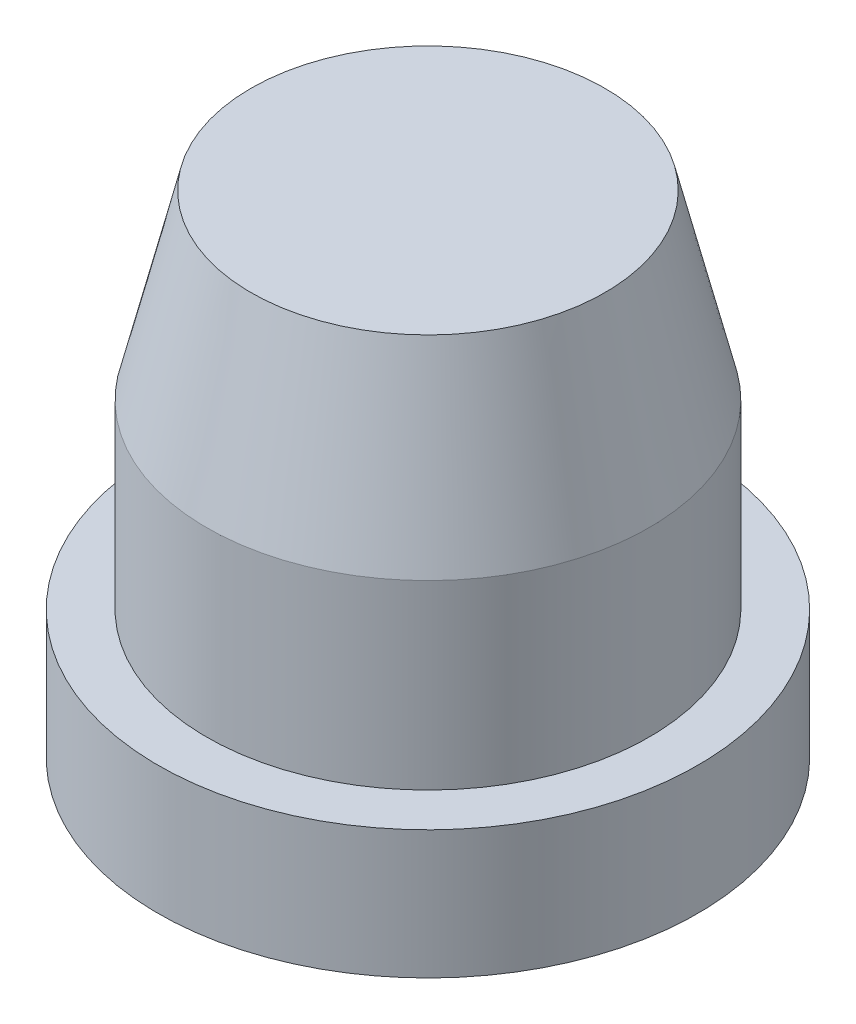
ISO-10303-21;
HEADER;
FILE_DESCRIPTION(('STEP AP214'),'2;1');
FILE_NAME('part.step','',(''),(''),'','','');
FILE_SCHEMA(('AUTOMOTIVE_DESIGN { 1 0 10303 214 1 1 1 1 }'));
ENDSEC;
DATA;
#1=APPLICATION_CONTEXT('core data for automotive mechanical design processes');
#2=APPLICATION_PROTOCOL_DEFINITION('international standard','automotive_design',2000,#1);
#3=PRODUCT_CONTEXT('',#1,'mechanical');
#4=PRODUCT('Part','Part','',(#3));
#5=PRODUCT_RELATED_PRODUCT_CATEGORY('part','',(#4));
#6=PRODUCT_DEFINITION_FORMATION('','',#4);
#7=PRODUCT_DEFINITION_CONTEXT('part definition',#1,'design');
#8=PRODUCT_DEFINITION('design','',#6,#7);
#9=PRODUCT_DEFINITION_SHAPE('','',#8);
#10=(LENGTH_UNIT() NAMED_UNIT(*) SI_UNIT(.MILLI.,.METRE.));
#11=(NAMED_UNIT(*) PLANE_ANGLE_UNIT() SI_UNIT($,.RADIAN.));
#12=(NAMED_UNIT(*) SI_UNIT($,.STERADIAN.) SOLID_ANGLE_UNIT());
#13=UNCERTAINTY_MEASURE_WITH_UNIT(LENGTH_MEASURE(1.E-05),#10,'distance_accuracy_value','');
#14=(GEOMETRIC_REPRESENTATION_CONTEXT(3) GLOBAL_UNCERTAINTY_ASSIGNED_CONTEXT((#13)) GLOBAL_UNIT_ASSIGNED_CONTEXT((#10,
#11,#12)) REPRESENTATION_CONTEXT('',''));
#15=CARTESIAN_POINT('',(0.,0.,0.));
#16=DIRECTION('',(0.,0.,1.));
#17=DIRECTION('',(1.,0.,0.));
#18=AXIS2_PLACEMENT_3D('',#15,#16,#17);
#19=CARTESIAN_POINT('',(0.,0.,0.));
#20=DIRECTION('',(0.,-1.,0.));
#21=DIRECTION('',(1.,0.,0.));
#22=AXIS2_PLACEMENT_3D('',#19,#20,#21);
#23=PLANE('',#22);
#24=CARTESIAN_POINT('',(0.,0.,0.));
#25=DIRECTION('',(0.,-1.,0.));
#26=DIRECTION('',(1.,0.,0.));
#27=AXIS2_PLACEMENT_3D('',#24,#25,#26);
#28=CIRCLE('',#27,4.3);
#29=CARTESIAN_POINT('',(4.3,0.,0.));
#30=VERTEX_POINT('',#29);
#31=EDGE_CURVE('E11',#30,#30,#28,.F.);
#32=ORIENTED_EDGE('',*,*,#31,.T.);
#33=EDGE_LOOP('',(#32));
#34=FACE_BOUND('',#33,.T.);
#35=CARTESIAN_POINT('',(0.,0.,0.));
#36=DIRECTION('',(0.,1.,0.));
#37=DIRECTION('',(-1.,0.,0.));
#38=AXIS2_PLACEMENT_3D('',#35,#36,#37);
#39=CIRCLE('',#38,6.1);
#40=CARTESIAN_POINT('',(-6.1,0.,0.));
#41=VERTEX_POINT('',#40);
#42=EDGE_CURVE('E45',#41,#41,#39,.T.);
#43=ORIENTED_EDGE('',*,*,#42,.F.);
#44=EDGE_LOOP('',(#43));
#45=FACE_BOUND('',#44,.T.);
#46=ADVANCED_FACE('F34',(#34,#45),#23,.T.);
#47=CARTESIAN_POINT('',(0.,11.1,0.));
#48=DIRECTION('',(0.,1.,0.));
#49=DIRECTION('',(-1.,0.,0.));
#50=AXIS2_PLACEMENT_3D('',#47,#48,#49);
#51=CYLINDRICAL_SURFACE('',#50,6.1);
#52=ORIENTED_EDGE('',*,*,#42,.T.);
#53=EDGE_LOOP('',(#52));
#54=FACE_BOUND('',#53,.T.);
#55=CARTESIAN_POINT('',(0.,2.9,0.));
#56=DIRECTION('',(0.,1.,0.));
#57=DIRECTION('',(-1.,0.,0.));
#58=AXIS2_PLACEMENT_3D('',#55,#56,#57);
#59=CIRCLE('',#58,6.1);
#60=CARTESIAN_POINT('',(-6.1,2.9,0.));
#61=VERTEX_POINT('',#60);
#62=EDGE_CURVE('E49',#61,#61,#59,.T.);
#63=ORIENTED_EDGE('',*,*,#62,.F.);
#64=EDGE_LOOP('',(#63));
#65=FACE_BOUND('',#64,.T.);
#66=ADVANCED_FACE('F90',(#54,#65),#51,.T.);
#67=CARTESIAN_POINT('',(-6.1,2.9,0.));
#68=DIRECTION('',(0.,1.,0.));
#69=DIRECTION('',(-1.,0.,0.));
#70=AXIS2_PLACEMENT_3D('',#67,#68,#69);
#71=PLANE('',#70);
#72=ORIENTED_EDGE('',*,*,#62,.T.);
#73=EDGE_LOOP('',(#72));
#74=FACE_BOUND('',#73,.T.);
#75=CARTESIAN_POINT('',(0.,2.9,0.));
#76=DIRECTION('',(0.,1.,0.));
#77=DIRECTION('',(-1.,0.,0.));
#78=AXIS2_PLACEMENT_3D('',#75,#76,#77);
#79=CIRCLE('',#78,5.);
#80=CARTESIAN_POINT('',(-5.,2.9,0.));
#81=VERTEX_POINT('',#80);
#82=EDGE_CURVE('E54',#81,#81,#79,.T.);
#83=ORIENTED_EDGE('',*,*,#82,.F.);
#84=EDGE_LOOP('',(#83));
#85=FACE_BOUND('',#84,.T.);
#86=ADVANCED_FACE('F94',(#74,#85),#71,.T.);
#87=CARTESIAN_POINT('',(0.,11.1,0.));
#88=DIRECTION('',(0.,1.,0.));
#89=DIRECTION('',(-1.,0.,0.));
#90=AXIS2_PLACEMENT_3D('',#87,#88,#89);
#91=CYLINDRICAL_SURFACE('',#90,5.);
#92=ORIENTED_EDGE('',*,*,#82,.T.);
#93=EDGE_LOOP('',(#92));
#94=FACE_BOUND('',#93,.T.);
#95=CARTESIAN_POINT('',(0.,7.,0.));
#96=DIRECTION('',(0.,1.,0.));
#97=DIRECTION('',(-1.,0.,0.));
#98=AXIS2_PLACEMENT_3D('',#95,#96,#97);
#99=CIRCLE('',#98,5.);
#100=CARTESIAN_POINT('',(-5.,7.,0.));
#101=VERTEX_POINT('',#100);
#102=EDGE_CURVE('E57',#101,#101,#99,.T.);
#103=ORIENTED_EDGE('',*,*,#102,.F.);
#104=EDGE_LOOP('',(#103));
#105=FACE_BOUND('',#104,.T.);
#106=ADVANCED_FACE('F101',(#94,#105),#91,.T.);
#107=CARTESIAN_POINT('',(0.,11.1,0.));
#108=DIRECTION('',(0.,-1.,0.));
#109=DIRECTION('',(1.,0.,0.));
#110=AXIS2_PLACEMENT_3D('',#107,#108,#109);
#111=CONICAL_SURFACE('',#110,4.,0.23923159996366);
#112=ORIENTED_EDGE('',*,*,#102,.T.);
#113=EDGE_LOOP('',(#112));
#114=FACE_BOUND('',#113,.T.);
#115=CARTESIAN_POINT('',(0.,11.1,0.));
#116=DIRECTION('',(0.,1.,0.));
#117=DIRECTION('',(-1.,0.,0.));
#118=AXIS2_PLACEMENT_3D('',#115,#116,#117);
#119=CIRCLE('',#118,4.);
#120=CARTESIAN_POINT('',(-4.,11.1,0.));
#121=VERTEX_POINT('',#120);
#122=EDGE_CURVE('E60',#121,#121,#119,.T.);
#123=ORIENTED_EDGE('',*,*,#122,.F.);
#124=EDGE_LOOP('',(#123));
#125=FACE_BOUND('',#124,.T.);
#126=ADVANCED_FACE('F105',(#114,#125),#111,.T.);
#127=CARTESIAN_POINT('',(-4.,11.1,0.));
#128=DIRECTION('',(0.,1.,0.));
#129=DIRECTION('',(-1.,0.,0.));
#130=AXIS2_PLACEMENT_3D('',#127,#128,#129);
#131=PLANE('',#130);
#132=ORIENTED_EDGE('',*,*,#122,.T.);
#133=EDGE_LOOP('',(#132));
#134=FACE_BOUND('',#133,.T.);
#135=ADVANCED_FACE('F109',(#134),#131,.T.);
#136=CARTESIAN_POINT('',(0.,2.3,0.));
#137=DIRECTION('',(0.,-1.,0.));
#138=DIRECTION('',(1.,0.,0.));
#139=AXIS2_PLACEMENT_3D('',#136,#137,#138);
#140=CYLINDRICAL_SURFACE('',#139,2.8);
#141=CARTESIAN_POINT('',(0.,1.5,0.));
#142=DIRECTION('',(0.,-1.,0.));
#143=DIRECTION('',(1.,0.,0.));
#144=AXIS2_PLACEMENT_3D('',#141,#142,#143);
#145=CIRCLE('',#144,2.8);
#146=CARTESIAN_POINT('',(2.8,1.5,0.));
#147=VERTEX_POINT('',#146);
#148=EDGE_CURVE('E41',#147,#147,#145,.T.);
#149=ORIENTED_EDGE('',*,*,#148,.T.);
#150=EDGE_LOOP('',(#149));
#151=FACE_BOUND('',#150,.T.);
#152=CARTESIAN_POINT('',(0.,2.3,0.));
#153=DIRECTION('',(0.,-1.,0.));
#154=DIRECTION('',(1.,0.,0.));
#155=AXIS2_PLACEMENT_3D('',#152,#153,#154);
#156=CIRCLE('',#155,2.8);
#157=CARTESIAN_POINT('',(2.8,2.3,0.));
#158=VERTEX_POINT('',#157);
#159=EDGE_CURVE('E63',#158,#158,#156,.T.);
#160=ORIENTED_EDGE('',*,*,#159,.F.);
#161=EDGE_LOOP('',(#160));
#162=FACE_BOUND('',#161,.T.);
#163=ADVANCED_FACE('F86',(#151,#162),#140,.F.);
#164=CARTESIAN_POINT('',(0.,31.7137084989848,0.));
#165=DIRECTION('',(0.,-1.,0.));
#166=DIRECTION('',(1.,0.,0.));
#167=AXIS2_PLACEMENT_3D('',#164,#165,#166);
#168=CYLINDRICAL_SURFACE('',#167,4.);
#169=CARTESIAN_POINT('',(0.,10.2,0.));
#170=DIRECTION('',(0.,-1.,0.));
#171=DIRECTION('',(1.,0.,0.));
#172=AXIS2_PLACEMENT_3D('',#169,#170,#171);
#173=CIRCLE('',#172,4.);
#174=CARTESIAN_POINT('',(4.,10.2,0.));
#175=VERTEX_POINT('',#174);
#176=EDGE_CURVE('E66',#175,#175,#173,.F.);
#177=ORIENTED_EDGE('',*,*,#176,.T.);
#178=EDGE_LOOP('',(#177));
#179=FACE_BOUND('',#178,.T.);
#180=CARTESIAN_POINT('',(0.,2.3,0.));
#181=DIRECTION('',(0.,-1.,0.));
#182=DIRECTION('',(1.,0.,0.));
#183=AXIS2_PLACEMENT_3D('',#180,#181,#182);
#184=CIRCLE('',#183,4.);
#185=CARTESIAN_POINT('',(4.,2.3,0.));
#186=VERTEX_POINT('',#185);
#187=EDGE_CURVE('E69',#186,#186,#184,.T.);
#188=ORIENTED_EDGE('',*,*,#187,.T.);
#189=EDGE_LOOP('',(#188));
#190=FACE_BOUND('',#189,.T.);
#191=ADVANCED_FACE('F73',(#179,#190),#168,.F.);
#192=CARTESIAN_POINT('',(0.,2.3,0.));
#193=DIRECTION('',(0.,-1.,0.));
#194=DIRECTION('',(1.,0.,0.));
#195=AXIS2_PLACEMENT_3D('',#192,#193,#194);
#196=PLANE('',#195);
#197=ORIENTED_EDGE('',*,*,#159,.T.);
#198=EDGE_LOOP('',(#197));
#199=FACE_BOUND('',#198,.T.);
#200=ORIENTED_EDGE('',*,*,#187,.F.);
#201=EDGE_LOOP('',(#200));
#202=FACE_BOUND('',#201,.T.);
#203=ADVANCED_FACE('F75',(#199,#202),#196,.F.);
#204=CARTESIAN_POINT('',(0.,10.2,0.));
#205=DIRECTION('',(0.,-1.,0.));
#206=DIRECTION('',(1.,0.,0.));
#207=AXIS2_PLACEMENT_3D('',#204,#205,#206);
#208=PLANE('',#207);
#209=ORIENTED_EDGE('',*,*,#176,.F.);
#210=EDGE_LOOP('',(#209));
#211=FACE_BOUND('',#210,.T.);
#212=ADVANCED_FACE('F77',(#211),#208,.T.);
#213=CARTESIAN_POINT('',(0.,1.5,0.));
#214=DIRECTION('',(0.,-1.,0.));
#215=DIRECTION('',(1.,0.,0.));
#216=AXIS2_PLACEMENT_3D('',#213,#214,#215);
#217=TOROIDAL_SURFACE('',#216,4.3,1.5);
#218=ORIENTED_EDGE('',*,*,#31,.F.);
#219=EDGE_LOOP('',(#218));
#220=FACE_BOUND('',#219,.T.);
#221=ORIENTED_EDGE('',*,*,#148,.F.);
#222=EDGE_LOOP('',(#221));
#223=FACE_BOUND('',#222,.T.);
#224=ADVANCED_FACE('F36',(#220,#223),#217,.T.);
#225=CLOSED_SHELL('',(#46,#66,#86,#106,#126,#135,#163,#191,#203,#212,#224));
#226=MANIFOLD_SOLID_BREP('B2',#225);
#227=ADVANCED_BREP_SHAPE_REPRESENTATION('',(#18,#226),#14);
#228=SHAPE_DEFINITION_REPRESENTATION(#9,#227);
ENDSEC;
END-ISO-10303-21;
